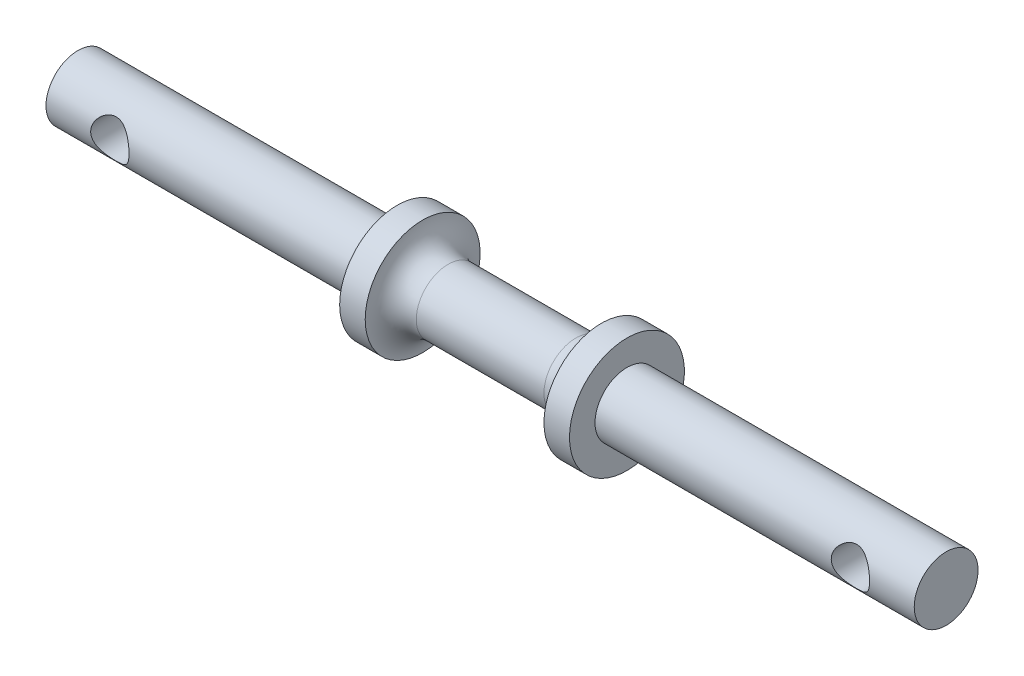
from build123d import *

# Parameters (mm, degrees)
SKETCH2_R          = 1.5
CUT_EXTRUDE1_DEPTH = 5


with BuildPart() as part:
    # Sketch1 → Revolve1 (revolve)
    with BuildSketch(Plane.XY, mode=Mode.PRIVATE) as revolve1_sk:
        with BuildLine():
            Line((0, 0), (68, 0))
            Line((68, 0), (68, 2.5))
            Line((68, 2.5), (43, 2.5))
            Line((43, 2.5), (43, 4.5))
            Line((43, 4.5), (41, 4.5))
            ThreePointArc((41, 4.5), (40.414213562, 3.085786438), (39, 2.5))
            Line((39, 2.5), (29, 2.5))
            ThreePointArc((29, 2.5), (27.585786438, 3.085786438), (27, 4.5))
            Line((27, 4.5), (25, 4.5))
            Line((25, 4.5), (25, 2.5))
            Line((25, 2.5), (0, 2.5))
            Line((0, 2.5), (0, 0))
        make_face()
    revolve(revolve1_sk.sketch.rotate(Axis((0, 0, 0), (1, 0, 0)), 90), axis=Axis((0, 0, 0), (1, 0, 0)))

    # Sketch2 → Cut-Extrude1 (cut, symmetric)
    with BuildSketch(Plane.XY):
        with Locations((63, 0)):
            Circle(SKETCH2_R)
        with Locations((5, 0)):
            Circle(SKETCH2_R)
    extrude(amount=CUT_EXTRUDE1_DEPTH, both=True, mode=Mode.SUBTRACT)


solid = part.part
